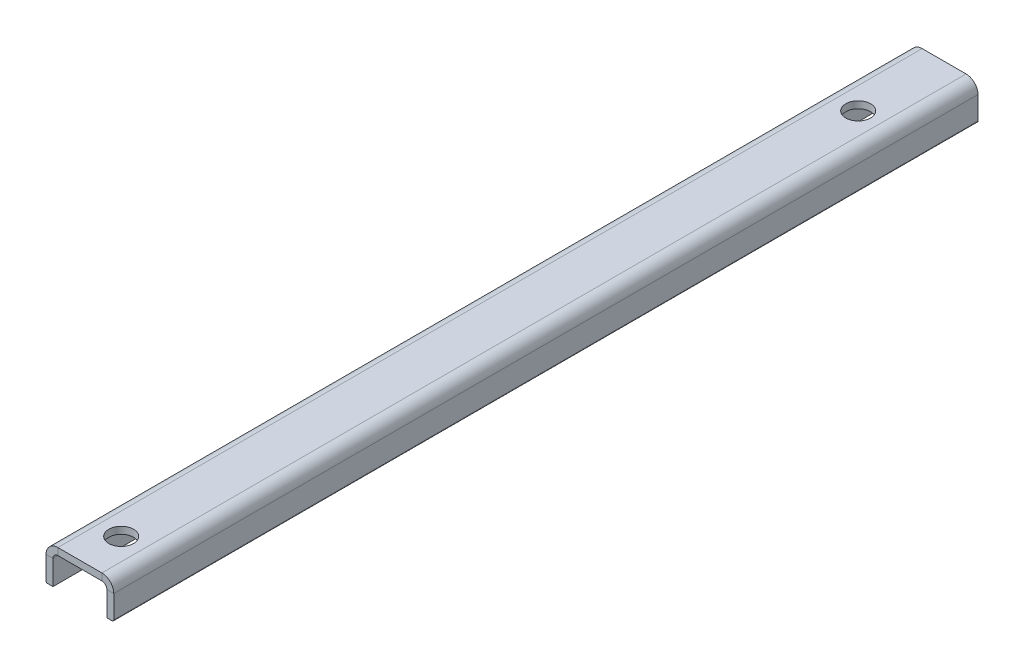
ISO-10303-21;
HEADER;
FILE_DESCRIPTION(('STEP AP214'),'2;1');
FILE_NAME('part.step','',(''),(''),'','','');
FILE_SCHEMA(('AUTOMOTIVE_DESIGN { 1 0 10303 214 1 1 1 1 }'));
ENDSEC;
DATA;
#1=APPLICATION_CONTEXT('core data for automotive mechanical design processes');
#2=APPLICATION_PROTOCOL_DEFINITION('international standard','automotive_design',2000,#1);
#3=PRODUCT_CONTEXT('',#1,'mechanical');
#4=PRODUCT('Part','Part','',(#3));
#5=PRODUCT_RELATED_PRODUCT_CATEGORY('part','',(#4));
#6=PRODUCT_DEFINITION_FORMATION('','',#4);
#7=PRODUCT_DEFINITION_CONTEXT('part definition',#1,'design');
#8=PRODUCT_DEFINITION('design','',#6,#7);
#9=PRODUCT_DEFINITION_SHAPE('','',#8);
#10=(LENGTH_UNIT() NAMED_UNIT(*) SI_UNIT(.MILLI.,.METRE.));
#11=(NAMED_UNIT(*) PLANE_ANGLE_UNIT() SI_UNIT($,.RADIAN.));
#12=(NAMED_UNIT(*) SI_UNIT($,.STERADIAN.) SOLID_ANGLE_UNIT());
#13=UNCERTAINTY_MEASURE_WITH_UNIT(LENGTH_MEASURE(1.E-05),#10,'distance_accuracy_value','');
#14=(GEOMETRIC_REPRESENTATION_CONTEXT(3) GLOBAL_UNCERTAINTY_ASSIGNED_CONTEXT((#13)) GLOBAL_UNIT_ASSIGNED_CONTEXT((#10,
#11,#12)) REPRESENTATION_CONTEXT('',''));
#15=CARTESIAN_POINT('',(0.,0.,0.));
#16=DIRECTION('',(0.,0.,1.));
#17=DIRECTION('',(1.,0.,0.));
#18=AXIS2_PLACEMENT_3D('',#15,#16,#17);
#19=CARTESIAN_POINT('',(-3.3782,0.,132.842));
#20=DIRECTION('',(0.,0.,1.));
#21=DIRECTION('',(1.,0.,0.));
#22=AXIS2_PLACEMENT_3D('',#19,#20,#21);
#23=PLANE('',#22);
#24=DIRECTION('',(0.,-1.,0.));
#25=VECTOR('',#24,1.);
#26=CARTESIAN_POINT('',(-3.3782,0.,132.842));
#27=LINE('',#26,#25);
#28=CARTESIAN_POINT('',(-3.3782,0.,132.842));
#29=VERTEX_POINT('',#28);
#30=CARTESIAN_POINT('',(-3.3782,-1.0668,132.842));
#31=VERTEX_POINT('',#30);
#32=EDGE_CURVE('E254',#29,#31,#27,.T.);
#33=ORIENTED_EDGE('',*,*,#32,.F.);
#34=CARTESIAN_POINT('',(-3.3782,-1.8288,132.842));
#35=DIRECTION('',(0.,0.,1.));
#36=DIRECTION('',(1.,0.,0.));
#37=AXIS2_PLACEMENT_3D('',#34,#35,#36);
#38=CIRCLE('',#37,1.8288);
#39=CARTESIAN_POINT('',(-5.207,-1.8288,132.842));
#40=VERTEX_POINT('',#39);
#41=EDGE_CURVE('E197',#40,#29,#38,.F.);
#42=ORIENTED_EDGE('',*,*,#41,.F.);
#43=DIRECTION('',(-1.,0.,0.));
#44=VECTOR('',#43,1.);
#45=CARTESIAN_POINT('',(-4.1402,-1.8288,132.842));
#46=LINE('',#45,#44);
#47=CARTESIAN_POINT('',(-4.1402,-1.8288,132.842));
#48=VERTEX_POINT('',#47);
#49=EDGE_CURVE('E251',#48,#40,#46,.T.);
#50=ORIENTED_EDGE('',*,*,#49,.F.);
#51=CARTESIAN_POINT('',(-3.3782,-1.8288,132.842));
#52=DIRECTION('',(0.,0.,1.));
#53=DIRECTION('',(1.,0.,0.));
#54=AXIS2_PLACEMENT_3D('',#51,#52,#53);
#55=CIRCLE('',#54,0.762);
#56=EDGE_CURVE('E208',#48,#31,#55,.F.);
#57=ORIENTED_EDGE('',*,*,#56,.T.);
#58=EDGE_LOOP('',(#33,#42,#50,#57));
#59=FACE_BOUND('',#58,.T.);
#60=ADVANCED_FACE('F33',(#59),#23,.T.);
#61=CARTESIAN_POINT('',(-4.1402,-1.8288,132.842));
#62=DIRECTION('',(0.,0.,1.));
#63=DIRECTION('',(1.,0.,0.));
#64=AXIS2_PLACEMENT_3D('',#61,#62,#63);
#65=PLANE('',#64);
#66=DIRECTION('',(1.,0.,0.));
#67=VECTOR('',#66,1.);
#68=CARTESIAN_POINT('',(-5.207,0.,132.842));
#69=LINE('',#68,#67);
#70=CARTESIAN_POINT('',(3.3782,0.,132.842));
#71=VERTEX_POINT('',#70);
#72=EDGE_CURVE('E194',#29,#71,#69,.T.);
#73=ORIENTED_EDGE('',*,*,#72,.F.);
#74=ORIENTED_EDGE('',*,*,#32,.T.);
#75=DIRECTION('',(1.,0.,0.));
#76=VECTOR('',#75,1.);
#77=CARTESIAN_POINT('',(-5.207,-1.0668,132.842));
#78=LINE('',#77,#76);
#79=CARTESIAN_POINT('',(3.3782,-1.0668,132.842));
#80=VERTEX_POINT('',#79);
#81=EDGE_CURVE('E211',#31,#80,#78,.T.);
#82=ORIENTED_EDGE('',*,*,#81,.T.);
#83=DIRECTION('',(0.,1.,0.));
#84=VECTOR('',#83,1.);
#85=CARTESIAN_POINT('',(3.3782,-1.0668,132.842));
#86=LINE('',#85,#84);
#87=EDGE_CURVE('E243',#80,#71,#86,.T.);
#88=ORIENTED_EDGE('',*,*,#87,.T.);
#89=EDGE_LOOP('',(#73,#74,#82,#88));
#90=FACE_BOUND('',#89,.T.);
#91=ADVANCED_FACE('F300',(#90),#65,.T.);
#92=CARTESIAN_POINT('',(-5.207,-1.8288,0.));
#93=DIRECTION('',(0.,0.,-1.));
#94=DIRECTION('',(-1.,0.,0.));
#95=AXIS2_PLACEMENT_3D('',#92,#93,#94);
#96=PLANE('',#95);
#97=DIRECTION('',(1.,0.,0.));
#98=VECTOR('',#97,1.);
#99=CARTESIAN_POINT('',(-5.207,-1.8288,0.));
#100=LINE('',#99,#98);
#101=CARTESIAN_POINT('',(-5.207,-1.8288,0.));
#102=VERTEX_POINT('',#101);
#103=CARTESIAN_POINT('',(-4.1402,-1.8288,0.));
#104=VERTEX_POINT('',#103);
#105=EDGE_CURVE('E249',#102,#104,#100,.T.);
#106=ORIENTED_EDGE('',*,*,#105,.F.);
#107=CARTESIAN_POINT('',(-3.3782,-1.8288,0.));
#108=DIRECTION('',(0.,0.,1.));
#109=DIRECTION('',(1.,0.,0.));
#110=AXIS2_PLACEMENT_3D('',#107,#108,#109);
#111=CIRCLE('',#110,1.8288);
#112=CARTESIAN_POINT('',(-3.3782,0.,0.));
#113=VERTEX_POINT('',#112);
#114=EDGE_CURVE('E165',#102,#113,#111,.F.);
#115=ORIENTED_EDGE('',*,*,#114,.T.);
#116=DIRECTION('',(0.,1.,0.));
#117=VECTOR('',#116,1.);
#118=CARTESIAN_POINT('',(-3.3782,-1.0668,0.));
#119=LINE('',#118,#117);
#120=CARTESIAN_POINT('',(-3.3782,-1.0668,0.));
#121=VERTEX_POINT('',#120);
#122=EDGE_CURVE('E247',#121,#113,#119,.T.);
#123=ORIENTED_EDGE('',*,*,#122,.F.);
#124=CARTESIAN_POINT('',(-3.3782,-1.8288,0.));
#125=DIRECTION('',(0.,0.,1.));
#126=DIRECTION('',(1.,0.,0.));
#127=AXIS2_PLACEMENT_3D('',#124,#125,#126);
#128=CIRCLE('',#127,0.762);
#129=EDGE_CURVE('E176',#104,#121,#128,.F.);
#130=ORIENTED_EDGE('',*,*,#129,.F.);
#131=EDGE_LOOP('',(#106,#115,#123,#130));
#132=FACE_BOUND('',#131,.T.);
#133=ADVANCED_FACE('F305',(#132),#96,.T.);
#134=CARTESIAN_POINT('',(-3.3782,-1.0668,0.));
#135=DIRECTION('',(0.,0.,-1.));
#136=DIRECTION('',(-1.,0.,0.));
#137=AXIS2_PLACEMENT_3D('',#134,#135,#136);
#138=PLANE('',#137);
#139=DIRECTION('',(-1.,0.,0.));
#140=VECTOR('',#139,1.);
#141=CARTESIAN_POINT('',(-4.1402,-5.588,0.));
#142=LINE('',#141,#140);
#143=CARTESIAN_POINT('',(-4.1402,-5.588,0.));
#144=VERTEX_POINT('',#143);
#145=CARTESIAN_POINT('',(-4.953,-5.588,0.));
#146=VERTEX_POINT('',#145);
#147=EDGE_CURVE('E170',#144,#146,#142,.T.);
#148=ORIENTED_EDGE('',*,*,#147,.T.);
#149=CARTESIAN_POINT('',(-4.953,-5.334,0.));
#150=DIRECTION('',(0.,0.,-1.));
#151=DIRECTION('',(-1.,0.,0.));
#152=AXIS2_PLACEMENT_3D('',#149,#150,#151);
#153=CIRCLE('',#152,0.254);
#154=CARTESIAN_POINT('',(-5.207,-5.334,0.));
#155=VERTEX_POINT('',#154);
#156=EDGE_CURVE('E263',#146,#155,#153,.T.);
#157=ORIENTED_EDGE('',*,*,#156,.T.);
#158=DIRECTION('',(0.,1.,0.));
#159=VECTOR('',#158,1.);
#160=CARTESIAN_POINT('',(-5.207,-5.588,0.));
#161=LINE('',#160,#159);
#162=EDGE_CURVE('E168',#155,#102,#161,.T.);
#163=ORIENTED_EDGE('',*,*,#162,.T.);
#164=ORIENTED_EDGE('',*,*,#105,.T.);
#165=DIRECTION('',(0.,1.,0.));
#166=VECTOR('',#165,1.);
#167=CARTESIAN_POINT('',(-4.1402,-5.588,0.));
#168=LINE('',#167,#166);
#169=EDGE_CURVE('E173',#144,#104,#168,.T.);
#170=ORIENTED_EDGE('',*,*,#169,.F.);
#171=EDGE_LOOP('',(#148,#157,#163,#164,#170));
#172=FACE_BOUND('',#171,.T.);
#173=ADVANCED_FACE('F347',(#172),#138,.T.);
#174=CARTESIAN_POINT('',(5.207,-1.8288,132.842));
#175=DIRECTION('',(0.,0.,1.));
#176=DIRECTION('',(1.,0.,0.));
#177=AXIS2_PLACEMENT_3D('',#174,#175,#176);
#178=PLANE('',#177);
#179=DIRECTION('',(-1.,0.,0.));
#180=VECTOR('',#179,1.);
#181=CARTESIAN_POINT('',(5.207,-1.8288,132.842));
#182=LINE('',#181,#180);
#183=CARTESIAN_POINT('',(5.207,-1.8288,132.842));
#184=VERTEX_POINT('',#183);
#185=CARTESIAN_POINT('',(4.1402,-1.8288,132.842));
#186=VERTEX_POINT('',#185);
#187=EDGE_CURVE('E245',#184,#186,#182,.T.);
#188=ORIENTED_EDGE('',*,*,#187,.F.);
#189=CARTESIAN_POINT('',(3.3782,-1.8288,132.842));
#190=DIRECTION('',(0.,0.,1.));
#191=DIRECTION('',(1.,0.,0.));
#192=AXIS2_PLACEMENT_3D('',#189,#190,#191);
#193=CIRCLE('',#192,1.8288);
#194=EDGE_CURVE('E191',#71,#184,#193,.F.);
#195=ORIENTED_EDGE('',*,*,#194,.F.);
#196=ORIENTED_EDGE('',*,*,#87,.F.);
#197=CARTESIAN_POINT('',(3.3782,-1.8288,132.842));
#198=DIRECTION('',(0.,0.,1.));
#199=DIRECTION('',(1.,0.,0.));
#200=AXIS2_PLACEMENT_3D('',#197,#198,#199);
#201=CIRCLE('',#200,0.762);
#202=EDGE_CURVE('E214',#80,#186,#201,.F.);
#203=ORIENTED_EDGE('',*,*,#202,.T.);
#204=EDGE_LOOP('',(#188,#195,#196,#203));
#205=FACE_BOUND('',#204,.T.);
#206=ADVANCED_FACE('F345',(#205),#178,.T.);
#207=CARTESIAN_POINT('',(3.3782,-1.0668,132.842));
#208=DIRECTION('',(0.,0.,1.));
#209=DIRECTION('',(1.,0.,0.));
#210=AXIS2_PLACEMENT_3D('',#207,#208,#209);
#211=PLANE('',#210);
#212=DIRECTION('',(-1.,0.,0.));
#213=VECTOR('',#212,1.);
#214=CARTESIAN_POINT('',(5.207,-5.588,132.842));
#215=LINE('',#214,#213);
#216=CARTESIAN_POINT('',(4.953,-5.588,132.842));
#217=VERTEX_POINT('',#216);
#218=CARTESIAN_POINT('',(4.1402,-5.588,132.842));
#219=VERTEX_POINT('',#218);
#220=EDGE_CURVE('E139',#217,#219,#215,.T.);
#221=ORIENTED_EDGE('',*,*,#220,.F.);
#222=CARTESIAN_POINT('',(4.953,-5.334,132.842));
#223=DIRECTION('',(0.,0.,1.));
#224=DIRECTION('',(1.,0.,0.));
#225=AXIS2_PLACEMENT_3D('',#222,#223,#224);
#226=CIRCLE('',#225,0.254);
#227=CARTESIAN_POINT('',(5.207,-5.334,132.842));
#228=VERTEX_POINT('',#227);
#229=EDGE_CURVE('E11',#217,#228,#226,.T.);
#230=ORIENTED_EDGE('',*,*,#229,.T.);
#231=DIRECTION('',(0.,-1.,0.));
#232=VECTOR('',#231,1.);
#233=CARTESIAN_POINT('',(5.207,0.,132.842));
#234=LINE('',#233,#232);
#235=EDGE_CURVE('E188',#184,#228,#234,.T.);
#236=ORIENTED_EDGE('',*,*,#235,.F.);
#237=ORIENTED_EDGE('',*,*,#187,.T.);
#238=DIRECTION('',(0.,1.,0.));
#239=VECTOR('',#238,1.);
#240=CARTESIAN_POINT('',(4.1402,0.,132.842));
#241=LINE('',#240,#239);
#242=EDGE_CURVE('E185',#186,#219,#241,.F.);
#243=ORIENTED_EDGE('',*,*,#242,.T.);
#244=EDGE_LOOP('',(#221,#230,#236,#237,#243));
#245=FACE_BOUND('',#244,.T.);
#246=ADVANCED_FACE('F288',(#245),#211,.T.);
#247=CARTESIAN_POINT('',(3.3782,0.,0.));
#248=DIRECTION('',(0.,0.,-1.));
#249=DIRECTION('',(-1.,0.,0.));
#250=AXIS2_PLACEMENT_3D('',#247,#248,#249);
#251=PLANE('',#250);
#252=DIRECTION('',(0.,-1.,0.));
#253=VECTOR('',#252,1.);
#254=CARTESIAN_POINT('',(3.3782,0.,0.));
#255=LINE('',#254,#253);
#256=CARTESIAN_POINT('',(3.3782,0.,0.));
#257=VERTEX_POINT('',#256);
#258=CARTESIAN_POINT('',(3.3782,-1.0668,0.));
#259=VERTEX_POINT('',#258);
#260=EDGE_CURVE('E241',#257,#259,#255,.T.);
#261=ORIENTED_EDGE('',*,*,#260,.F.);
#262=CARTESIAN_POINT('',(3.3782,-1.8288,0.));
#263=DIRECTION('',(0.,0.,1.));
#264=DIRECTION('',(1.,0.,0.));
#265=AXIS2_PLACEMENT_3D('',#262,#263,#264);
#266=CIRCLE('',#265,1.8288);
#267=CARTESIAN_POINT('',(5.207,-1.8288,0.));
#268=VERTEX_POINT('',#267);
#269=EDGE_CURVE('E159',#257,#268,#266,.F.);
#270=ORIENTED_EDGE('',*,*,#269,.T.);
#271=DIRECTION('',(1.,0.,0.));
#272=VECTOR('',#271,1.);
#273=CARTESIAN_POINT('',(4.1402,-1.8288,0.));
#274=LINE('',#273,#272);
#275=CARTESIAN_POINT('',(4.1402,-1.8288,0.));
#276=VERTEX_POINT('',#275);
#277=EDGE_CURVE('E143',#276,#268,#274,.T.);
#278=ORIENTED_EDGE('',*,*,#277,.F.);
#279=CARTESIAN_POINT('',(3.3782,-1.8288,0.));
#280=DIRECTION('',(0.,0.,1.));
#281=DIRECTION('',(1.,0.,0.));
#282=AXIS2_PLACEMENT_3D('',#279,#280,#281);
#283=CIRCLE('',#282,0.762);
#284=EDGE_CURVE('E182',#259,#276,#283,.F.);
#285=ORIENTED_EDGE('',*,*,#284,.F.);
#286=EDGE_LOOP('',(#261,#270,#278,#285));
#287=FACE_BOUND('',#286,.T.);
#288=ADVANCED_FACE('F354',(#287),#251,.T.);
#289=CARTESIAN_POINT('',(4.1402,-1.8288,0.));
#290=DIRECTION('',(0.,0.,-1.));
#291=DIRECTION('',(-1.,0.,0.));
#292=AXIS2_PLACEMENT_3D('',#289,#290,#291);
#293=PLANE('',#292);
#294=DIRECTION('',(1.,0.,0.));
#295=VECTOR('',#294,1.);
#296=CARTESIAN_POINT('',(-5.207,0.,0.));
#297=LINE('',#296,#295);
#298=EDGE_CURVE('E162',#113,#257,#297,.T.);
#299=ORIENTED_EDGE('',*,*,#298,.T.);
#300=ORIENTED_EDGE('',*,*,#260,.T.);
#301=DIRECTION('',(1.,0.,0.));
#302=VECTOR('',#301,1.);
#303=CARTESIAN_POINT('',(-5.207,-1.0668,0.));
#304=LINE('',#303,#302);
#305=EDGE_CURVE('E179',#121,#259,#304,.T.);
#306=ORIENTED_EDGE('',*,*,#305,.F.);
#307=ORIENTED_EDGE('',*,*,#122,.T.);
#308=EDGE_LOOP('',(#299,#300,#306,#307));
#309=FACE_BOUND('',#308,.T.);
#310=ADVANCED_FACE('F393',(#309),#293,.T.);
#311=CARTESIAN_POINT('',(4.1402,0.,132.842));
#312=DIRECTION('',(1.,0.,0.));
#313=DIRECTION('',(0.,0.,-1.));
#314=AXIS2_PLACEMENT_3D('',#311,#312,#313);
#315=PLANE('',#314);
#316=DIRECTION('',(0.,1.,0.));
#317=VECTOR('',#316,1.);
#318=CARTESIAN_POINT('',(4.1402,0.,0.));
#319=LINE('',#318,#317);
#320=CARTESIAN_POINT('',(4.1402,-5.588,0.));
#321=VERTEX_POINT('',#320);
#322=EDGE_CURVE('E133',#276,#321,#319,.F.);
#323=ORIENTED_EDGE('',*,*,#322,.T.);
#324=DIRECTION('',(0.,0.,-1.));
#325=VECTOR('',#324,1.);
#326=CARTESIAN_POINT('',(4.1402,-5.588,132.842));
#327=LINE('',#326,#325);
#328=EDGE_CURVE('E137',#219,#321,#327,.T.);
#329=ORIENTED_EDGE('',*,*,#328,.F.);
#330=ORIENTED_EDGE('',*,*,#242,.F.);
#331=DIRECTION('',(0.,0.,-1.));
#332=VECTOR('',#331,1.);
#333=CARTESIAN_POINT('',(4.1402,-1.8288,132.842));
#334=LINE('',#333,#332);
#335=EDGE_CURVE('E149',#186,#276,#334,.T.);
#336=ORIENTED_EDGE('',*,*,#335,.T.);
#337=EDGE_LOOP('',(#323,#329,#330,#336));
#338=FACE_BOUND('',#337,.T.);
#339=ADVANCED_FACE('F147',(#338),#315,.F.);
#340=CARTESIAN_POINT('',(5.207,-5.588,132.842));
#341=DIRECTION('',(0.,-1.,0.));
#342=DIRECTION('',(0.,0.,-1.));
#343=AXIS2_PLACEMENT_3D('',#340,#341,#342);
#344=PLANE('',#343);
#345=DIRECTION('',(-1.,0.,0.));
#346=VECTOR('',#345,1.);
#347=CARTESIAN_POINT('',(5.207,-5.588,0.));
#348=LINE('',#347,#346);
#349=CARTESIAN_POINT('',(4.953,-5.588,0.));
#350=VERTEX_POINT('',#349);
#351=EDGE_CURVE('E129',#350,#321,#348,.T.);
#352=ORIENTED_EDGE('',*,*,#351,.F.);
#353=DIRECTION('',(0.,0.,-1.));
#354=VECTOR('',#353,1.);
#355=CARTESIAN_POINT('',(4.953,-5.588,132.842));
#356=LINE('',#355,#354);
#357=EDGE_CURVE('E40',#350,#217,#356,.F.);
#358=ORIENTED_EDGE('',*,*,#357,.T.);
#359=ORIENTED_EDGE('',*,*,#220,.T.);
#360=ORIENTED_EDGE('',*,*,#328,.T.);
#361=EDGE_LOOP('',(#352,#358,#359,#360));
#362=FACE_BOUND('',#361,.T.);
#363=ADVANCED_FACE('F138',(#362),#344,.T.);
#364=CARTESIAN_POINT('',(5.207,0.,132.842));
#365=DIRECTION('',(1.,0.,0.));
#366=DIRECTION('',(0.,0.,-1.));
#367=AXIS2_PLACEMENT_3D('',#364,#365,#366);
#368=PLANE('',#367);
#369=ORIENTED_EDGE('',*,*,#235,.T.);
#370=DIRECTION('',(0.,0.,-1.));
#371=VECTOR('',#370,1.);
#372=CARTESIAN_POINT('',(5.207,-5.334,132.842));
#373=LINE('',#372,#371);
#374=CARTESIAN_POINT('',(5.207,-5.334,0.));
#375=VERTEX_POINT('',#374);
#376=EDGE_CURVE('E269',#228,#375,#373,.T.);
#377=ORIENTED_EDGE('',*,*,#376,.T.);
#378=DIRECTION('',(0.,-1.,0.));
#379=VECTOR('',#378,1.);
#380=CARTESIAN_POINT('',(5.207,0.,0.));
#381=LINE('',#380,#379);
#382=EDGE_CURVE('E134',#268,#375,#381,.T.);
#383=ORIENTED_EDGE('',*,*,#382,.F.);
#384=DIRECTION('',(0.,0.,-1.));
#385=VECTOR('',#384,1.);
#386=CARTESIAN_POINT('',(5.207,-1.8288,132.842));
#387=LINE('',#386,#385);
#388=EDGE_CURVE('E144',#184,#268,#387,.T.);
#389=ORIENTED_EDGE('',*,*,#388,.F.);
#390=EDGE_LOOP('',(#369,#377,#383,#389));
#391=FACE_BOUND('',#390,.T.);
#392=ADVANCED_FACE('F275',(#391),#368,.T.);
#393=CARTESIAN_POINT('',(3.3782,-1.8288,132.842));
#394=DIRECTION('',(0.,0.,-1.));
#395=DIRECTION('',(-1.,0.,0.));
#396=AXIS2_PLACEMENT_3D('',#393,#394,#395);
#397=CYLINDRICAL_SURFACE('',#396,1.8288);
#398=ORIENTED_EDGE('',*,*,#269,.F.);
#399=DIRECTION('',(0.,0.,-1.));
#400=VECTOR('',#399,1.);
#401=CARTESIAN_POINT('',(3.3782,0.,132.842));
#402=LINE('',#401,#400);
#403=EDGE_CURVE('E235',#71,#257,#402,.T.);
#404=ORIENTED_EDGE('',*,*,#403,.F.);
#405=ORIENTED_EDGE('',*,*,#194,.T.);
#406=ORIENTED_EDGE('',*,*,#388,.T.);
#407=EDGE_LOOP('',(#398,#404,#405,#406));
#408=FACE_BOUND('',#407,.T.);
#409=ADVANCED_FACE('F284',(#408),#397,.T.);
#410=CARTESIAN_POINT('',(-5.207,0.,132.842));
#411=DIRECTION('',(0.,1.,0.));
#412=DIRECTION('',(0.,0.,1.));
#413=AXIS2_PLACEMENT_3D('',#410,#411,#412);
#414=PLANE('',#413);
#415=CARTESIAN_POINT('',(0.,0.,126.492));
#416=DIRECTION('',(0.,1.,0.));
#417=DIRECTION('',(0.,0.,1.));
#418=AXIS2_PLACEMENT_3D('',#415,#416,#417);
#419=CIRCLE('',#418,1.90499999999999);
#420=CARTESIAN_POINT('',(0.,0.,128.397));
#421=VERTEX_POINT('',#420);
#422=EDGE_CURVE('E260',#421,#421,#419,.T.);
#423=ORIENTED_EDGE('',*,*,#422,.F.);
#424=EDGE_LOOP('',(#423));
#425=FACE_BOUND('',#424,.T.);
#426=CARTESIAN_POINT('',(0.,0.,13.208));
#427=DIRECTION('',(0.,1.,0.));
#428=DIRECTION('',(0.,0.,1.));
#429=AXIS2_PLACEMENT_3D('',#426,#427,#428);
#430=CIRCLE('',#429,1.905);
#431=CARTESIAN_POINT('',(0.,0.,15.113));
#432=VERTEX_POINT('',#431);
#433=EDGE_CURVE('E153',#432,#432,#430,.T.);
#434=ORIENTED_EDGE('',*,*,#433,.F.);
#435=EDGE_LOOP('',(#434));
#436=FACE_BOUND('',#435,.T.);
#437=ORIENTED_EDGE('',*,*,#298,.F.);
#438=DIRECTION('',(0.,0.,-1.));
#439=VECTOR('',#438,1.);
#440=CARTESIAN_POINT('',(-3.3782,0.,132.842));
#441=LINE('',#440,#439);
#442=EDGE_CURVE('E232',#29,#113,#441,.T.);
#443=ORIENTED_EDGE('',*,*,#442,.F.);
#444=ORIENTED_EDGE('',*,*,#72,.T.);
#445=ORIENTED_EDGE('',*,*,#403,.T.);
#446=EDGE_LOOP('',(#437,#443,#444,#445));
#447=FACE_BOUND('',#446,.T.);
#448=ADVANCED_FACE('F314',(#425,#436,#447),#414,.T.);
#449=CARTESIAN_POINT('',(-3.3782,-1.8288,132.842));
#450=DIRECTION('',(0.,0.,-1.));
#451=DIRECTION('',(-1.,0.,0.));
#452=AXIS2_PLACEMENT_3D('',#449,#450,#451);
#453=CYLINDRICAL_SURFACE('',#452,1.8288);
#454=ORIENTED_EDGE('',*,*,#114,.F.);
#455=DIRECTION('',(0.,0.,-1.));
#456=VECTOR('',#455,1.);
#457=CARTESIAN_POINT('',(-5.207,-1.8288,132.842));
#458=LINE('',#457,#456);
#459=EDGE_CURVE('E229',#40,#102,#458,.T.);
#460=ORIENTED_EDGE('',*,*,#459,.F.);
#461=ORIENTED_EDGE('',*,*,#41,.T.);
#462=ORIENTED_EDGE('',*,*,#442,.T.);
#463=EDGE_LOOP('',(#454,#460,#461,#462));
#464=FACE_BOUND('',#463,.T.);
#465=ADVANCED_FACE('F318',(#464),#453,.T.);
#466=CARTESIAN_POINT('',(-5.207,-5.588,132.842));
#467=DIRECTION('',(-1.,0.,0.));
#468=DIRECTION('',(0.,0.,1.));
#469=AXIS2_PLACEMENT_3D('',#466,#467,#468);
#470=PLANE('',#469);
#471=ORIENTED_EDGE('',*,*,#162,.F.);
#472=DIRECTION('',(0.,0.,-1.));
#473=VECTOR('',#472,1.);
#474=CARTESIAN_POINT('',(-5.207,-5.334,132.842));
#475=LINE('',#474,#473);
#476=CARTESIAN_POINT('',(-5.207,-5.334,132.842));
#477=VERTEX_POINT('',#476);
#478=EDGE_CURVE('E265',#155,#477,#475,.F.);
#479=ORIENTED_EDGE('',*,*,#478,.T.);
#480=DIRECTION('',(0.,1.,0.));
#481=VECTOR('',#480,1.);
#482=CARTESIAN_POINT('',(-5.207,-5.588,132.842));
#483=LINE('',#482,#481);
#484=EDGE_CURVE('E200',#477,#40,#483,.T.);
#485=ORIENTED_EDGE('',*,*,#484,.T.);
#486=ORIENTED_EDGE('',*,*,#459,.T.);
#487=EDGE_LOOP('',(#471,#479,#485,#486));
#488=FACE_BOUND('',#487,.T.);
#489=ADVANCED_FACE('F321',(#488),#470,.T.);
#490=CARTESIAN_POINT('',(-4.1402,-5.588,132.842));
#491=DIRECTION('',(0.,-1.,0.));
#492=DIRECTION('',(0.,0.,-1.));
#493=AXIS2_PLACEMENT_3D('',#490,#491,#492);
#494=PLANE('',#493);
#495=DIRECTION('',(-1.,0.,0.));
#496=VECTOR('',#495,1.);
#497=CARTESIAN_POINT('',(-4.1402,-5.588,132.842));
#498=LINE('',#497,#496);
#499=CARTESIAN_POINT('',(-4.1402,-5.588,132.842));
#500=VERTEX_POINT('',#499);
#501=CARTESIAN_POINT('',(-4.953,-5.588,132.842));
#502=VERTEX_POINT('',#501);
#503=EDGE_CURVE('E202',#500,#502,#498,.T.);
#504=ORIENTED_EDGE('',*,*,#503,.T.);
#505=DIRECTION('',(0.,0.,-1.));
#506=VECTOR('',#505,1.);
#507=CARTESIAN_POINT('',(-4.953,-5.588,132.842));
#508=LINE('',#507,#506);
#509=EDGE_CURVE('E255',#502,#146,#508,.T.);
#510=ORIENTED_EDGE('',*,*,#509,.T.);
#511=ORIENTED_EDGE('',*,*,#147,.F.);
#512=DIRECTION('',(0.,0.,-1.));
#513=VECTOR('',#512,1.);
#514=CARTESIAN_POINT('',(-4.1402,-5.588,132.842));
#515=LINE('',#514,#513);
#516=EDGE_CURVE('E227',#500,#144,#515,.T.);
#517=ORIENTED_EDGE('',*,*,#516,.F.);
#518=EDGE_LOOP('',(#504,#510,#511,#517));
#519=FACE_BOUND('',#518,.T.);
#520=ADVANCED_FACE('F368',(#519),#494,.T.);
#521=CARTESIAN_POINT('',(-4.1402,-5.588,132.842));
#522=DIRECTION('',(-1.,0.,0.));
#523=DIRECTION('',(0.,0.,1.));
#524=AXIS2_PLACEMENT_3D('',#521,#522,#523);
#525=PLANE('',#524);
#526=ORIENTED_EDGE('',*,*,#169,.T.);
#527=DIRECTION('',(0.,0.,-1.));
#528=VECTOR('',#527,1.);
#529=CARTESIAN_POINT('',(-4.1402,-1.8288,132.842));
#530=LINE('',#529,#528);
#531=EDGE_CURVE('E224',#48,#104,#530,.T.);
#532=ORIENTED_EDGE('',*,*,#531,.F.);
#533=DIRECTION('',(0.,1.,0.));
#534=VECTOR('',#533,1.);
#535=CARTESIAN_POINT('',(-4.1402,-5.588,132.842));
#536=LINE('',#535,#534);
#537=EDGE_CURVE('E205',#500,#48,#536,.T.);
#538=ORIENTED_EDGE('',*,*,#537,.F.);
#539=ORIENTED_EDGE('',*,*,#516,.T.);
#540=EDGE_LOOP('',(#526,#532,#538,#539));
#541=FACE_BOUND('',#540,.T.);
#542=ADVANCED_FACE('F331',(#541),#525,.F.);
#543=CARTESIAN_POINT('',(-3.3782,-1.8288,132.842));
#544=DIRECTION('',(0.,0.,-1.));
#545=DIRECTION('',(-1.,0.,0.));
#546=AXIS2_PLACEMENT_3D('',#543,#544,#545);
#547=CYLINDRICAL_SURFACE('',#546,0.762);
#548=ORIENTED_EDGE('',*,*,#129,.T.);
#549=DIRECTION('',(0.,0.,-1.));
#550=VECTOR('',#549,1.);
#551=CARTESIAN_POINT('',(-3.3782,-1.0668,132.842));
#552=LINE('',#551,#550);
#553=EDGE_CURVE('E221',#31,#121,#552,.T.);
#554=ORIENTED_EDGE('',*,*,#553,.F.);
#555=ORIENTED_EDGE('',*,*,#56,.F.);
#556=ORIENTED_EDGE('',*,*,#531,.T.);
#557=EDGE_LOOP('',(#548,#554,#555,#556));
#558=FACE_BOUND('',#557,.T.);
#559=ADVANCED_FACE('F335',(#558),#547,.F.);
#560=CARTESIAN_POINT('',(-5.207,-1.0668,132.842));
#561=DIRECTION('',(0.,1.,0.));
#562=DIRECTION('',(0.,0.,1.));
#563=AXIS2_PLACEMENT_3D('',#560,#561,#562);
#564=PLANE('',#563);
#565=CARTESIAN_POINT('',(0.,-1.0668,126.492));
#566=DIRECTION('',(0.,1.,0.));
#567=DIRECTION('',(0.,0.,1.));
#568=AXIS2_PLACEMENT_3D('',#565,#566,#567);
#569=CIRCLE('',#568,1.90499999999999);
#570=CARTESIAN_POINT('',(0.,-1.0668,128.397));
#571=VERTEX_POINT('',#570);
#572=EDGE_CURVE('E257',#571,#571,#569,.T.);
#573=ORIENTED_EDGE('',*,*,#572,.T.);
#574=EDGE_LOOP('',(#573));
#575=FACE_BOUND('',#574,.T.);
#576=CARTESIAN_POINT('',(0.,-1.0668,13.208));
#577=DIRECTION('',(0.,1.,0.));
#578=DIRECTION('',(0.,0.,1.));
#579=AXIS2_PLACEMENT_3D('',#576,#577,#578);
#580=CIRCLE('',#579,1.905);
#581=CARTESIAN_POINT('',(0.,-1.0668,15.113));
#582=VERTEX_POINT('',#581);
#583=EDGE_CURVE('E150',#582,#582,#580,.T.);
#584=ORIENTED_EDGE('',*,*,#583,.T.);
#585=EDGE_LOOP('',(#584));
#586=FACE_BOUND('',#585,.T.);
#587=ORIENTED_EDGE('',*,*,#305,.T.);
#588=DIRECTION('',(0.,0.,-1.));
#589=VECTOR('',#588,1.);
#590=CARTESIAN_POINT('',(3.3782,-1.0668,132.842));
#591=LINE('',#590,#589);
#592=EDGE_CURVE('E218',#80,#259,#591,.T.);
#593=ORIENTED_EDGE('',*,*,#592,.F.);
#594=ORIENTED_EDGE('',*,*,#81,.F.);
#595=ORIENTED_EDGE('',*,*,#553,.T.);
#596=EDGE_LOOP('',(#587,#593,#594,#595));
#597=FACE_BOUND('',#596,.T.);
#598=ADVANCED_FACE('F340',(#575,#586,#597),#564,.F.);
#599=CARTESIAN_POINT('',(3.3782,-1.8288,132.842));
#600=DIRECTION('',(0.,0.,-1.));
#601=DIRECTION('',(-1.,0.,0.));
#602=AXIS2_PLACEMENT_3D('',#599,#600,#601);
#603=CYLINDRICAL_SURFACE('',#602,0.762);
#604=ORIENTED_EDGE('',*,*,#284,.T.);
#605=ORIENTED_EDGE('',*,*,#335,.F.);
#606=ORIENTED_EDGE('',*,*,#202,.F.);
#607=ORIENTED_EDGE('',*,*,#592,.T.);
#608=EDGE_LOOP('',(#604,#605,#606,#607));
#609=FACE_BOUND('',#608,.T.);
#610=ADVANCED_FACE('F343',(#609),#603,.F.);
#611=CARTESIAN_POINT('',(3.3782,-1.8288,132.842));
#612=DIRECTION('',(0.,0.,1.));
#613=DIRECTION('',(1.,0.,0.));
#614=AXIS2_PLACEMENT_3D('',#611,#612,#613);
#615=PLANE('',#614);
#616=ORIENTED_EDGE('',*,*,#484,.F.);
#617=CARTESIAN_POINT('',(-4.953,-5.334,132.842));
#618=DIRECTION('',(0.,0.,1.));
#619=DIRECTION('',(1.,0.,0.));
#620=AXIS2_PLACEMENT_3D('',#617,#618,#619);
#621=CIRCLE('',#620,0.254);
#622=EDGE_CURVE('E267',#477,#502,#621,.T.);
#623=ORIENTED_EDGE('',*,*,#622,.T.);
#624=ORIENTED_EDGE('',*,*,#503,.F.);
#625=ORIENTED_EDGE('',*,*,#537,.T.);
#626=ORIENTED_EDGE('',*,*,#49,.T.);
#627=EDGE_LOOP('',(#616,#623,#624,#625,#626));
#628=FACE_BOUND('',#627,.T.);
#629=ADVANCED_FACE('F326',(#628),#615,.T.);
#630=CARTESIAN_POINT('',(3.3782,-1.8288,0.));
#631=DIRECTION('',(0.,0.,1.));
#632=DIRECTION('',(1.,0.,0.));
#633=AXIS2_PLACEMENT_3D('',#630,#631,#632);
#634=PLANE('',#633);
#635=ORIENTED_EDGE('',*,*,#382,.T.);
#636=CARTESIAN_POINT('',(4.953,-5.334,0.));
#637=DIRECTION('',(0.,0.,1.));
#638=DIRECTION('',(1.,0.,0.));
#639=AXIS2_PLACEMENT_3D('',#636,#637,#638);
#640=CIRCLE('',#639,0.254);
#641=EDGE_CURVE('E54',#375,#350,#640,.F.);
#642=ORIENTED_EDGE('',*,*,#641,.T.);
#643=ORIENTED_EDGE('',*,*,#351,.T.);
#644=ORIENTED_EDGE('',*,*,#322,.F.);
#645=ORIENTED_EDGE('',*,*,#277,.T.);
#646=EDGE_LOOP('',(#635,#642,#643,#644,#645));
#647=FACE_BOUND('',#646,.T.);
#648=ADVANCED_FACE('F131',(#647),#634,.F.);
#649=CARTESIAN_POINT('',(0.,-5.588,13.208));
#650=DIRECTION('',(0.,1.,0.));
#651=DIRECTION('',(0.,0.,1.));
#652=AXIS2_PLACEMENT_3D('',#649,#650,#651);
#653=CYLINDRICAL_SURFACE('',#652,1.905);
#654=ORIENTED_EDGE('',*,*,#433,.T.);
#655=EDGE_LOOP('',(#654));
#656=FACE_BOUND('',#655,.T.);
#657=ORIENTED_EDGE('',*,*,#583,.F.);
#658=EDGE_LOOP('',(#657));
#659=FACE_BOUND('',#658,.T.);
#660=ADVANCED_FACE('F458',(#656,#659),#653,.F.);
#661=CARTESIAN_POINT('',(0.,-5.588,126.492));
#662=DIRECTION('',(0.,1.,0.));
#663=DIRECTION('',(0.,0.,1.));
#664=AXIS2_PLACEMENT_3D('',#661,#662,#663);
#665=CYLINDRICAL_SURFACE('',#664,1.90499999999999);
#666=ORIENTED_EDGE('',*,*,#422,.T.);
#667=EDGE_LOOP('',(#666));
#668=FACE_BOUND('',#667,.T.);
#669=ORIENTED_EDGE('',*,*,#572,.F.);
#670=EDGE_LOOP('',(#669));
#671=FACE_BOUND('',#670,.T.);
#672=ADVANCED_FACE('F296',(#668,#671),#665,.F.);
#673=CARTESIAN_POINT('',(-4.953,-5.334,132.842));
#674=DIRECTION('',(0.,0.,-1.));
#675=DIRECTION('',(-1.,0.,0.));
#676=AXIS2_PLACEMENT_3D('',#673,#674,#675);
#677=CYLINDRICAL_SURFACE('',#676,0.254);
#678=ORIENTED_EDGE('',*,*,#622,.F.);
#679=ORIENTED_EDGE('',*,*,#478,.F.);
#680=ORIENTED_EDGE('',*,*,#156,.F.);
#681=ORIENTED_EDGE('',*,*,#509,.F.);
#682=EDGE_LOOP('',(#678,#679,#680,#681));
#683=FACE_BOUND('',#682,.T.);
#684=ADVANCED_FACE('F291',(#683),#677,.T.);
#685=CARTESIAN_POINT('',(4.953,-5.334,132.842));
#686=DIRECTION('',(0.,0.,-1.));
#687=DIRECTION('',(-1.,0.,0.));
#688=AXIS2_PLACEMENT_3D('',#685,#686,#687);
#689=CYLINDRICAL_SURFACE('',#688,0.254);
#690=ORIENTED_EDGE('',*,*,#229,.F.);
#691=ORIENTED_EDGE('',*,*,#357,.F.);
#692=ORIENTED_EDGE('',*,*,#641,.F.);
#693=ORIENTED_EDGE('',*,*,#376,.F.);
#694=EDGE_LOOP('',(#690,#691,#692,#693));
#695=FACE_BOUND('',#694,.T.);
#696=ADVANCED_FACE('F289',(#695),#689,.T.);
#697=CLOSED_SHELL('',(#60,#91,#133,#173,#206,#246,#288,#310,#339,#363,#392,#409,#448,#465,#489,
#520,#542,#559,#598,#610,#629,#648,#660,#672,#684,#696));
#698=MANIFOLD_SOLID_BREP('B2',#697);
#699=ADVANCED_BREP_SHAPE_REPRESENTATION('',(#18,#698),#14);
#700=SHAPE_DEFINITION_REPRESENTATION(#9,#699);
ENDSEC;
END-ISO-10303-21;
